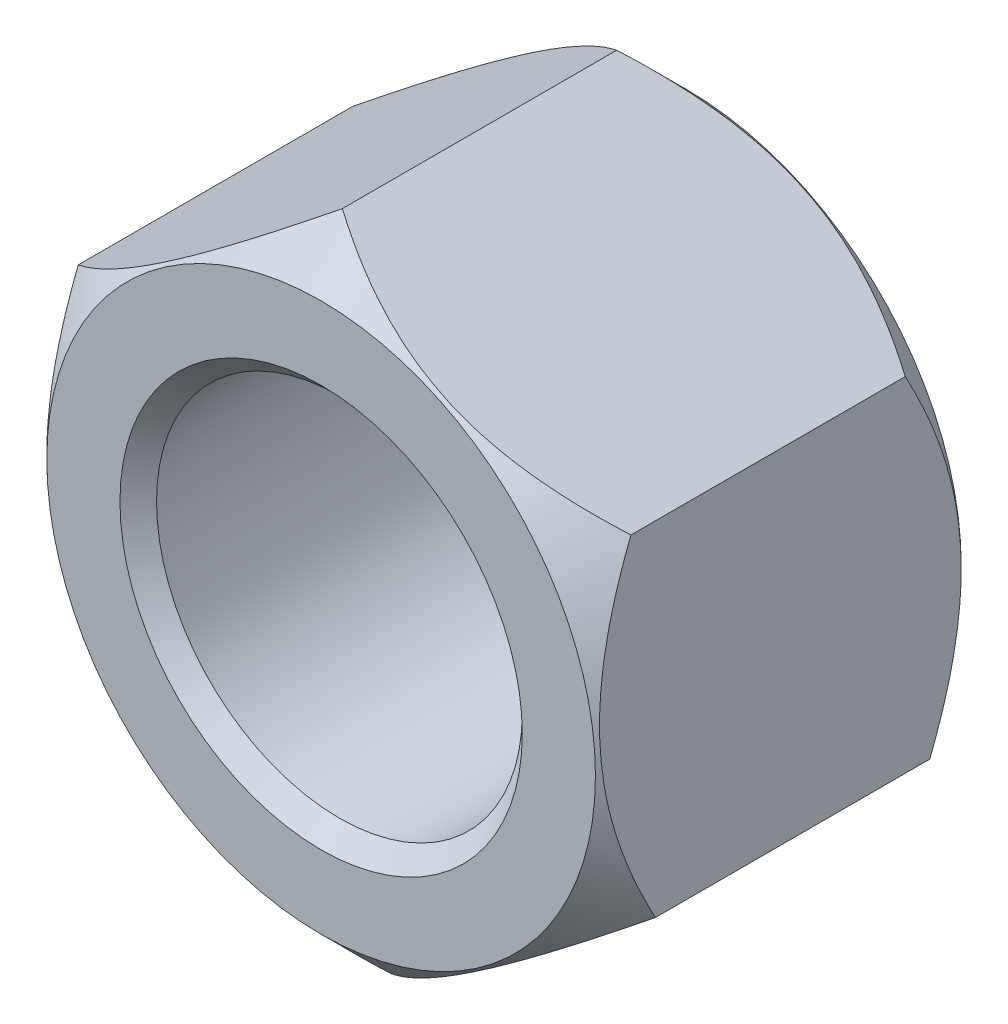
from build123d import *

# Parameters (mm, degrees)
ESQUISSE1_R                  = 3.5
ESQUISSE1_R_2                = 2
BOSS_EXTRU_1_DEPTH           = 4
CHANFREIN1_SIZE              = 0.5
ENL_V_MAT_EXTRU_1_DEPTH      = 7.363961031
R_P_TITION_CIRCULAIRE1_COUNT = 6
CHANFREIN2_SIZE              = 0.2


with BuildPart() as part:
    # Esquisse1 → Boss.-Extru.1 (new body)
    with BuildSketch(Plane.XY):
        Circle(ESQUISSE1_R)
        Circle(ESQUISSE1_R_2, mode=Mode.SUBTRACT)
    extrude(amount=BOSS_EXTRU_1_DEPTH)

    # Chanfrein1
    chanfrein1_edges = [part.edges().sort_by_distance(p)[0] for p in [
        (-3.5, 0, 0),
        (-3.5, 0, 4),
    ]]
    chamfer(chanfrein1_edges, length=CHANFREIN1_SIZE)

    # Esquisse2 → Enl_v. mat.-Extru.1 (cut, through all)
    with BuildSketch(Plane.XY.offset(4)):
        with BuildLine():
            Line((-3.156069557, 1.513018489), (-0.267722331, 3.489745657))
            ThreePointArc((-0.267722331, 3.489745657), (-1.976727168, 2.888347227), (-3.156069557, 1.513018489))
        make_face()
    enl_v_mat_extru_1 = extrude(amount=-ENL_V_MAT_EXTRU_1_DEPTH, mode=Mode.SUBTRACT)

    # R_p_tition circulaire1: Enl_v. mat.-Extru.1 ×6 about axis
    r_p_tition_circulaire1_axis = Axis((0, 0, 0), (0, 0, 1))
    for i in range(1, R_P_TITION_CIRCULAIRE1_COUNT):
        add(enl_v_mat_extru_1.rotate(r_p_tition_circulaire1_axis, i * 360 / R_P_TITION_CIRCULAIRE1_COUNT), mode=Mode.SUBTRACT)

    # Chanfrein2
    chanfrein2_edges = [part.edges().sort_by_distance(p)[0] for p in [
        (-2, 0, 0),
        (-2, 0, 4),
    ]]
    chamfer(chanfrein2_edges, length=CHANFREIN2_SIZE)


solid = part.part
